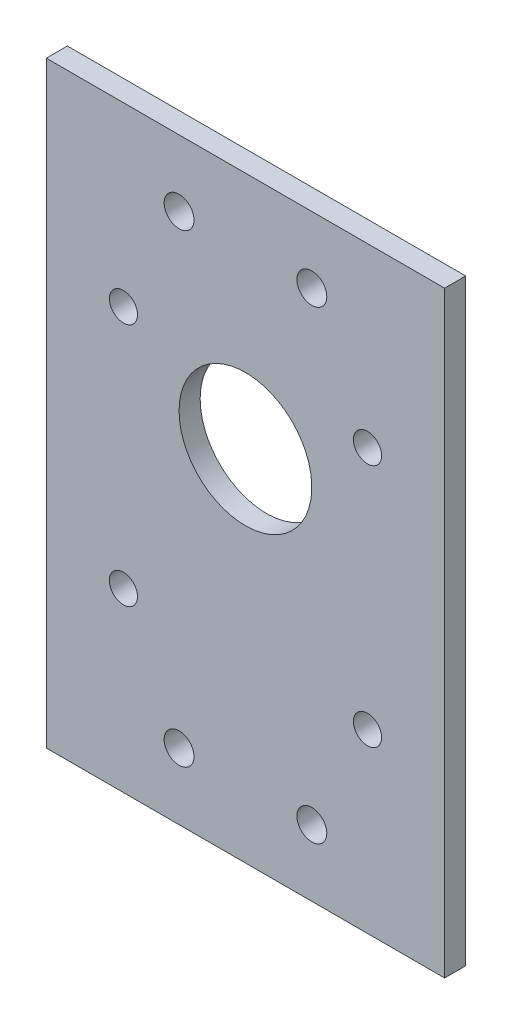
from build123d import *

# Parameters (mm, degrees)
SKETCH1_W                          = 180
SKETCH1_H                          = 120
BASE_PLATE_DEPTH                   = 3.175
M_PATTERN_2_R                      = 4.25
M_PATTERN_DEPTH                    = 109.352768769
F_PATTERN_2_R                      = 4.5
F_PATTERN_DEPTH                    = 109.352768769
SKETCH2_R                          = 20
GEARBOX_CLEARANCE_DIA40_THRU_DEPTH = 109.352768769


with BuildPart() as part:
    # Sketch1 → Base Plate (new, symmetric)
    with BuildSketch(Plane(origin=(0, 0, 0), x_dir=(0, 1, 0), z_dir=(0, 0, 1))):
        Rectangle(SKETCH1_W, SKETCH1_H)
    extrude(amount=BASE_PLATE_DEPTH, both=True)

    # M_Pattern 2 → M-Pattern (cut, through all)
    with BuildSketch(Plane.XY.offset(3.175)):
        with Locations((-36.77, 36.77)):
            Circle(M_PATTERN_2_R)
        with Locations((36.77, 36.77)):
            Circle(M_PATTERN_2_R)
        with Locations((36.77, -36.77)):
            Circle(M_PATTERN_2_R)
        with Locations((-36.77, -36.77)):
            Circle(M_PATTERN_2_R)
    extrude(amount=-M_PATTERN_DEPTH, mode=Mode.SUBTRACT)

    # F_Pattern 2 → F-Pattern (cut, through all)
    with BuildSketch(Plane.XY.offset(3.175)):
        with Locations((-20, 70)):
            Circle(F_PATTERN_2_R)
        with Locations((20, 70)):
            Circle(F_PATTERN_2_R)
        with Locations((20, -70)):
            Circle(F_PATTERN_2_R)
        with Locations((-20, -70)):
            Circle(F_PATTERN_2_R)
    extrude(amount=-F_PATTERN_DEPTH, mode=Mode.SUBTRACT)

    # Sketch2 → Gearbox Clearance - DIA40 THRU (cut, through all)
    with BuildSketch(Plane(origin=(0, 0, -3.175), x_dir=(-1, 0, 0), z_dir=(0, 0, -1))):
        with Locations((-0.000447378, 17.999552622)):
            Circle(SKETCH2_R)
    extrude(amount=-GEARBOX_CLEARANCE_DIA40_THRU_DEPTH, mode=Mode.SUBTRACT)


solid = part.part
